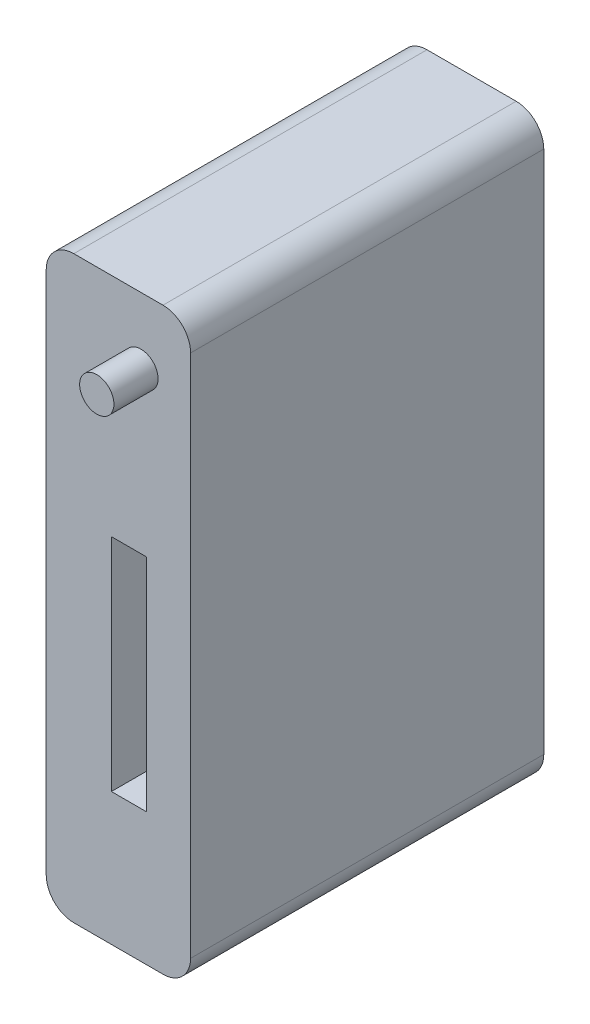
ISO-10303-21;
HEADER;
FILE_DESCRIPTION(('STEP AP214'),'2;1');
FILE_NAME('part.step','',(''),(''),'','','');
FILE_SCHEMA(('AUTOMOTIVE_DESIGN { 1 0 10303 214 1 1 1 1 }'));
ENDSEC;
DATA;
#1=APPLICATION_CONTEXT('core data for automotive mechanical design processes');
#2=APPLICATION_PROTOCOL_DEFINITION('international standard','automotive_design',2000,#1);
#3=PRODUCT_CONTEXT('',#1,'mechanical');
#4=PRODUCT('Part','Part','',(#3));
#5=PRODUCT_RELATED_PRODUCT_CATEGORY('part','',(#4));
#6=PRODUCT_DEFINITION_FORMATION('','',#4);
#7=PRODUCT_DEFINITION_CONTEXT('part definition',#1,'design');
#8=PRODUCT_DEFINITION('design','',#6,#7);
#9=PRODUCT_DEFINITION_SHAPE('','',#8);
#10=(LENGTH_UNIT() NAMED_UNIT(*) SI_UNIT(.MILLI.,.METRE.));
#11=(NAMED_UNIT(*) PLANE_ANGLE_UNIT() SI_UNIT($,.RADIAN.));
#12=(NAMED_UNIT(*) SI_UNIT($,.STERADIAN.) SOLID_ANGLE_UNIT());
#13=UNCERTAINTY_MEASURE_WITH_UNIT(LENGTH_MEASURE(1.E-05),#10,'distance_accuracy_value','');
#14=(GEOMETRIC_REPRESENTATION_CONTEXT(3) GLOBAL_UNCERTAINTY_ASSIGNED_CONTEXT((#13)) GLOBAL_UNIT_ASSIGNED_CONTEXT((#10,
#11,#12)) REPRESENTATION_CONTEXT('',''));
#15=CARTESIAN_POINT('',(0.,0.,0.));
#16=DIRECTION('',(0.,0.,1.));
#17=DIRECTION('',(1.,0.,0.));
#18=AXIS2_PLACEMENT_3D('',#15,#16,#17);
#19=CARTESIAN_POINT('',(-8.081,-47.5,32.));
#20=DIRECTION('',(0.,0.,-1.));
#21=DIRECTION('',(-1.,0.,0.));
#22=AXIS2_PLACEMENT_3D('',#19,#20,#21);
#23=CYLINDRICAL_SURFACE('',#22,5.);
#24=CARTESIAN_POINT('',(-8.081,-47.5,-32.));
#25=DIRECTION('',(0.,0.,1.));
#26=DIRECTION('',(-1.,0.,0.));
#27=AXIS2_PLACEMENT_3D('',#24,#25,#26);
#28=CIRCLE('',#27,5.);
#29=CARTESIAN_POINT('',(-13.081,-47.5,-32.));
#30=VERTEX_POINT('',#29);
#31=CARTESIAN_POINT('',(-8.081,-52.5,-32.));
#32=VERTEX_POINT('',#31);
#33=EDGE_CURVE('E141',#30,#32,#28,.T.);
#34=ORIENTED_EDGE('',*,*,#33,.T.);
#35=DIRECTION('',(0.,0.,-1.));
#36=VECTOR('',#35,1.);
#37=CARTESIAN_POINT('',(-8.081,-52.5,32.));
#38=LINE('',#37,#36);
#39=CARTESIAN_POINT('',(-8.081,-52.5,32.));
#40=VERTEX_POINT('',#39);
#41=EDGE_CURVE('E39',#40,#32,#38,.T.);
#42=ORIENTED_EDGE('',*,*,#41,.F.);
#43=CARTESIAN_POINT('',(-8.081,-47.5,32.));
#44=DIRECTION('',(0.,0.,1.));
#45=DIRECTION('',(-1.,0.,0.));
#46=AXIS2_PLACEMENT_3D('',#43,#44,#45);
#47=CIRCLE('',#46,5.);
#48=CARTESIAN_POINT('',(-13.081,-47.5,32.));
#49=VERTEX_POINT('',#48);
#50=EDGE_CURVE('E157',#49,#40,#47,.T.);
#51=ORIENTED_EDGE('',*,*,#50,.F.);
#52=DIRECTION('',(0.,0.,-1.));
#53=VECTOR('',#52,1.);
#54=CARTESIAN_POINT('',(-13.081,-47.5,32.));
#55=LINE('',#54,#53);
#56=EDGE_CURVE('E137',#49,#30,#55,.T.);
#57=ORIENTED_EDGE('',*,*,#56,.T.);
#58=EDGE_LOOP('',(#34,#42,#51,#57));
#59=FACE_BOUND('',#58,.T.);
#60=ADVANCED_FACE('F32',(#59),#23,.T.);
#61=CARTESIAN_POINT('',(-8.081,-52.5,32.));
#62=DIRECTION('',(0.,1.,0.));
#63=DIRECTION('',(0.,0.,1.));
#64=AXIS2_PLACEMENT_3D('',#61,#62,#63);
#65=PLANE('',#64);
#66=DIRECTION('',(1.,0.,0.));
#67=VECTOR('',#66,1.);
#68=CARTESIAN_POINT('',(-8.081,-52.5,-32.));
#69=LINE('',#68,#67);
#70=CARTESIAN_POINT('',(8.081,-52.5,-32.));
#71=VERTEX_POINT('',#70);
#72=EDGE_CURVE('E144',#32,#71,#69,.T.);
#73=ORIENTED_EDGE('',*,*,#72,.T.);
#74=DIRECTION('',(0.,0.,-1.));
#75=VECTOR('',#74,1.);
#76=CARTESIAN_POINT('',(8.081,-52.5,32.));
#77=LINE('',#76,#75);
#78=CARTESIAN_POINT('',(8.081,-52.5,32.));
#79=VERTEX_POINT('',#78);
#80=EDGE_CURVE('E167',#79,#71,#77,.T.);
#81=ORIENTED_EDGE('',*,*,#80,.F.);
#82=DIRECTION('',(1.,0.,0.));
#83=VECTOR('',#82,1.);
#84=CARTESIAN_POINT('',(-8.081,-52.5,32.));
#85=LINE('',#84,#83);
#86=EDGE_CURVE('E97',#40,#79,#85,.T.);
#87=ORIENTED_EDGE('',*,*,#86,.F.);
#88=ORIENTED_EDGE('',*,*,#41,.T.);
#89=EDGE_LOOP('',(#73,#81,#87,#88));
#90=FACE_BOUND('',#89,.T.);
#91=ADVANCED_FACE('F170',(#90),#65,.F.);
#92=CARTESIAN_POINT('',(8.081,-47.5,32.));
#93=DIRECTION('',(0.,0.,-1.));
#94=DIRECTION('',(-1.,0.,0.));
#95=AXIS2_PLACEMENT_3D('',#92,#93,#94);
#96=CYLINDRICAL_SURFACE('',#95,5.);
#97=CARTESIAN_POINT('',(8.081,-47.5,-32.));
#98=DIRECTION('',(0.,0.,1.));
#99=DIRECTION('',(1.,0.,0.));
#100=AXIS2_PLACEMENT_3D('',#97,#98,#99);
#101=CIRCLE('',#100,5.);
#102=CARTESIAN_POINT('',(13.081,-47.5,-32.));
#103=VERTEX_POINT('',#102);
#104=EDGE_CURVE('E147',#71,#103,#101,.T.);
#105=ORIENTED_EDGE('',*,*,#104,.T.);
#106=DIRECTION('',(0.,0.,-1.));
#107=VECTOR('',#106,1.);
#108=CARTESIAN_POINT('',(13.081,-47.5,32.));
#109=LINE('',#108,#107);
#110=CARTESIAN_POINT('',(13.081,-47.5,32.));
#111=VERTEX_POINT('',#110);
#112=EDGE_CURVE('E164',#111,#103,#109,.T.);
#113=ORIENTED_EDGE('',*,*,#112,.F.);
#114=CARTESIAN_POINT('',(8.081,-47.5,32.));
#115=DIRECTION('',(0.,0.,1.));
#116=DIRECTION('',(1.,0.,0.));
#117=AXIS2_PLACEMENT_3D('',#114,#115,#116);
#118=CIRCLE('',#117,5.);
#119=EDGE_CURVE('E188',#79,#111,#118,.T.);
#120=ORIENTED_EDGE('',*,*,#119,.F.);
#121=ORIENTED_EDGE('',*,*,#80,.T.);
#122=EDGE_LOOP('',(#105,#113,#120,#121));
#123=FACE_BOUND('',#122,.T.);
#124=ADVANCED_FACE('F181',(#123),#96,.T.);
#125=CARTESIAN_POINT('',(13.081,-47.5,32.));
#126=DIRECTION('',(-1.,0.,0.));
#127=DIRECTION('',(0.,0.,1.));
#128=AXIS2_PLACEMENT_3D('',#125,#126,#127);
#129=PLANE('',#128);
#130=DIRECTION('',(0.,1.,0.));
#131=VECTOR('',#130,1.);
#132=CARTESIAN_POINT('',(13.081,-47.5,-32.));
#133=LINE('',#132,#131);
#134=CARTESIAN_POINT('',(13.081,47.5,-32.));
#135=VERTEX_POINT('',#134);
#136=EDGE_CURVE('E149',#103,#135,#133,.T.);
#137=ORIENTED_EDGE('',*,*,#136,.T.);
#138=DIRECTION('',(0.,0.,-1.));
#139=VECTOR('',#138,1.);
#140=CARTESIAN_POINT('',(13.081,47.5,32.));
#141=LINE('',#140,#139);
#142=CARTESIAN_POINT('',(13.081,47.5,32.));
#143=VERTEX_POINT('',#142);
#144=EDGE_CURVE('E161',#143,#135,#141,.T.);
#145=ORIENTED_EDGE('',*,*,#144,.F.);
#146=DIRECTION('',(0.,1.,0.));
#147=VECTOR('',#146,1.);
#148=CARTESIAN_POINT('',(13.081,-47.5,32.));
#149=LINE('',#148,#147);
#150=EDGE_CURVE('E187',#111,#143,#149,.T.);
#151=ORIENTED_EDGE('',*,*,#150,.F.);
#152=ORIENTED_EDGE('',*,*,#112,.T.);
#153=EDGE_LOOP('',(#137,#145,#151,#152));
#154=FACE_BOUND('',#153,.T.);
#155=ADVANCED_FACE('F185',(#154),#129,.F.);
#156=CARTESIAN_POINT('',(8.081,47.5,32.));
#157=DIRECTION('',(0.,0.,-1.));
#158=DIRECTION('',(-1.,0.,0.));
#159=AXIS2_PLACEMENT_3D('',#156,#157,#158);
#160=CYLINDRICAL_SURFACE('',#159,5.);
#161=CARTESIAN_POINT('',(8.081,47.5,-32.));
#162=DIRECTION('',(0.,0.,1.));
#163=DIRECTION('',(-1.,0.,0.));
#164=AXIS2_PLACEMENT_3D('',#161,#162,#163);
#165=CIRCLE('',#164,5.);
#166=CARTESIAN_POINT('',(8.081,52.5,-32.));
#167=VERTEX_POINT('',#166);
#168=EDGE_CURVE('E151',#135,#167,#165,.T.);
#169=ORIENTED_EDGE('',*,*,#168,.T.);
#170=DIRECTION('',(0.,0.,-1.));
#171=VECTOR('',#170,1.);
#172=CARTESIAN_POINT('',(8.081,52.5,32.));
#173=LINE('',#172,#171);
#174=CARTESIAN_POINT('',(8.081,52.5,32.));
#175=VERTEX_POINT('',#174);
#176=EDGE_CURVE('E132',#175,#167,#173,.T.);
#177=ORIENTED_EDGE('',*,*,#176,.F.);
#178=CARTESIAN_POINT('',(8.081,47.5,32.));
#179=DIRECTION('',(0.,0.,1.));
#180=DIRECTION('',(-1.,0.,0.));
#181=AXIS2_PLACEMENT_3D('',#178,#179,#180);
#182=CIRCLE('',#181,5.);
#183=EDGE_CURVE('E120',#143,#175,#182,.T.);
#184=ORIENTED_EDGE('',*,*,#183,.F.);
#185=ORIENTED_EDGE('',*,*,#144,.T.);
#186=EDGE_LOOP('',(#169,#177,#184,#185));
#187=FACE_BOUND('',#186,.T.);
#188=ADVANCED_FACE('F288',(#187),#160,.T.);
#189=CARTESIAN_POINT('',(-8.081,52.5,32.));
#190=DIRECTION('',(0.,-1.,0.));
#191=DIRECTION('',(0.,0.,-1.));
#192=AXIS2_PLACEMENT_3D('',#189,#190,#191);
#193=PLANE('',#192);
#194=DIRECTION('',(-1.,0.,0.));
#195=VECTOR('',#194,1.);
#196=CARTESIAN_POINT('',(-8.081,52.5,-32.));
#197=LINE('',#196,#195);
#198=CARTESIAN_POINT('',(-8.081,52.5,-32.));
#199=VERTEX_POINT('',#198);
#200=EDGE_CURVE('E129',#167,#199,#197,.T.);
#201=ORIENTED_EDGE('',*,*,#200,.T.);
#202=DIRECTION('',(0.,0.,-1.));
#203=VECTOR('',#202,1.);
#204=CARTESIAN_POINT('',(-8.081,52.5,32.));
#205=LINE('',#204,#203);
#206=CARTESIAN_POINT('',(-8.081,52.5,32.));
#207=VERTEX_POINT('',#206);
#208=EDGE_CURVE('E126',#207,#199,#205,.T.);
#209=ORIENTED_EDGE('',*,*,#208,.F.);
#210=DIRECTION('',(-1.,0.,0.));
#211=VECTOR('',#210,1.);
#212=CARTESIAN_POINT('',(-8.081,52.5,32.));
#213=LINE('',#212,#211);
#214=EDGE_CURVE('E113',#175,#207,#213,.T.);
#215=ORIENTED_EDGE('',*,*,#214,.F.);
#216=ORIENTED_EDGE('',*,*,#176,.T.);
#217=EDGE_LOOP('',(#201,#209,#215,#216));
#218=FACE_BOUND('',#217,.T.);
#219=ADVANCED_FACE('F127',(#218),#193,.F.);
#220=CARTESIAN_POINT('',(-8.081,47.5,32.));
#221=DIRECTION('',(0.,0.,-1.));
#222=DIRECTION('',(-1.,0.,0.));
#223=AXIS2_PLACEMENT_3D('',#220,#221,#222);
#224=CYLINDRICAL_SURFACE('',#223,5.);
#225=CARTESIAN_POINT('',(-8.081,47.5,-32.));
#226=DIRECTION('',(0.,0.,1.));
#227=DIRECTION('',(-1.,0.,0.));
#228=AXIS2_PLACEMENT_3D('',#225,#226,#227);
#229=CIRCLE('',#228,5.);
#230=CARTESIAN_POINT('',(-13.081,47.5,-32.));
#231=VERTEX_POINT('',#230);
#232=EDGE_CURVE('E154',#199,#231,#229,.T.);
#233=ORIENTED_EDGE('',*,*,#232,.T.);
#234=DIRECTION('',(0.,0.,-1.));
#235=VECTOR('',#234,1.);
#236=CARTESIAN_POINT('',(-13.081,47.5,32.));
#237=LINE('',#236,#235);
#238=CARTESIAN_POINT('',(-13.081,47.5,32.));
#239=VERTEX_POINT('',#238);
#240=EDGE_CURVE('E133',#239,#231,#237,.T.);
#241=ORIENTED_EDGE('',*,*,#240,.F.);
#242=CARTESIAN_POINT('',(-8.081,47.5,32.));
#243=DIRECTION('',(0.,0.,1.));
#244=DIRECTION('',(-1.,0.,0.));
#245=AXIS2_PLACEMENT_3D('',#242,#243,#244);
#246=CIRCLE('',#245,5.);
#247=EDGE_CURVE('E117',#207,#239,#246,.T.);
#248=ORIENTED_EDGE('',*,*,#247,.F.);
#249=ORIENTED_EDGE('',*,*,#208,.T.);
#250=EDGE_LOOP('',(#233,#241,#248,#249));
#251=FACE_BOUND('',#250,.T.);
#252=ADVANCED_FACE('F135',(#251),#224,.T.);
#253=CARTESIAN_POINT('',(-13.081,-47.5,32.));
#254=DIRECTION('',(1.,0.,0.));
#255=DIRECTION('',(0.,0.,-1.));
#256=AXIS2_PLACEMENT_3D('',#253,#254,#255);
#257=PLANE('',#256);
#258=DIRECTION('',(0.,-1.,0.));
#259=VECTOR('',#258,1.);
#260=CARTESIAN_POINT('',(-13.081,-47.5,-32.));
#261=LINE('',#260,#259);
#262=EDGE_CURVE('E88',#231,#30,#261,.T.);
#263=ORIENTED_EDGE('',*,*,#262,.T.);
#264=ORIENTED_EDGE('',*,*,#56,.F.);
#265=DIRECTION('',(0.,-1.,0.));
#266=VECTOR('',#265,1.);
#267=CARTESIAN_POINT('',(-13.081,-47.5,32.));
#268=LINE('',#267,#266);
#269=EDGE_CURVE('E55',#239,#49,#268,.T.);
#270=ORIENTED_EDGE('',*,*,#269,.F.);
#271=ORIENTED_EDGE('',*,*,#240,.T.);
#272=EDGE_LOOP('',(#263,#264,#270,#271));
#273=FACE_BOUND('',#272,.T.);
#274=ADVANCED_FACE('F240',(#273),#257,.F.);
#275=CARTESIAN_POINT('',(-8.081,-47.5,32.));
#276=DIRECTION('',(0.,0.,-1.));
#277=DIRECTION('',(-1.,0.,0.));
#278=AXIS2_PLACEMENT_3D('',#275,#276,#277);
#279=PLANE('',#278);
#280=CARTESIAN_POINT('',(4.081,40.5,32.));
#281=DIRECTION('',(0.,0.,-1.));
#282=DIRECTION('',(-1.,0.,0.));
#283=AXIS2_PLACEMENT_3D('',#280,#281,#282);
#284=CIRCLE('',#283,3.105);
#285=CARTESIAN_POINT('',(0.975999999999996,40.5,32.));
#286=VERTEX_POINT('',#285);
#287=EDGE_CURVE('E11',#286,#286,#284,.F.);
#288=ORIENTED_EDGE('',*,*,#287,.F.);
#289=EDGE_LOOP('',(#288));
#290=FACE_BOUND('',#289,.T.);
#291=DIRECTION('',(1.,0.,0.));
#292=VECTOR('',#291,1.);
#293=CARTESIAN_POINT('',(-1.269,-28.5,32.));
#294=LINE('',#293,#292);
#295=CARTESIAN_POINT('',(-1.269,-28.5,32.));
#296=VERTEX_POINT('',#295);
#297=CARTESIAN_POINT('',(5.081,-28.5,32.));
#298=VERTEX_POINT('',#297);
#299=EDGE_CURVE('E211',#296,#298,#294,.T.);
#300=ORIENTED_EDGE('',*,*,#299,.F.);
#301=DIRECTION('',(0.,-1.,0.));
#302=VECTOR('',#301,1.);
#303=CARTESIAN_POINT('',(-1.269,-28.5,32.));
#304=LINE('',#303,#302);
#305=CARTESIAN_POINT('',(-1.269,11.5,32.));
#306=VERTEX_POINT('',#305);
#307=EDGE_CURVE('E46',#306,#296,#304,.T.);
#308=ORIENTED_EDGE('',*,*,#307,.F.);
#309=DIRECTION('',(-1.,0.,0.));
#310=VECTOR('',#309,1.);
#311=CARTESIAN_POINT('',(-1.269,11.5,32.));
#312=LINE('',#311,#310);
#313=CARTESIAN_POINT('',(5.081,11.5,32.));
#314=VERTEX_POINT('',#313);
#315=EDGE_CURVE('E204',#314,#306,#312,.T.);
#316=ORIENTED_EDGE('',*,*,#315,.F.);
#317=DIRECTION('',(0.,1.,0.));
#318=VECTOR('',#317,1.);
#319=CARTESIAN_POINT('',(5.081,-28.5,32.));
#320=LINE('',#319,#318);
#321=EDGE_CURVE('E208',#298,#314,#320,.T.);
#322=ORIENTED_EDGE('',*,*,#321,.F.);
#323=EDGE_LOOP('',(#300,#308,#316,#322));
#324=FACE_BOUND('',#323,.T.);
#325=ORIENTED_EDGE('',*,*,#50,.T.);
#326=ORIENTED_EDGE('',*,*,#86,.T.);
#327=ORIENTED_EDGE('',*,*,#119,.T.);
#328=ORIENTED_EDGE('',*,*,#150,.T.);
#329=ORIENTED_EDGE('',*,*,#183,.T.);
#330=ORIENTED_EDGE('',*,*,#214,.T.);
#331=ORIENTED_EDGE('',*,*,#247,.T.);
#332=ORIENTED_EDGE('',*,*,#269,.T.);
#333=EDGE_LOOP('',(#325,#326,#327,#328,#329,#330,#331,#332));
#334=FACE_BOUND('',#333,.T.);
#335=ADVANCED_FACE('F115',(#290,#324,#334),#279,.F.);
#336=CARTESIAN_POINT('',(-8.081,-47.5,-32.));
#337=DIRECTION('',(0.,0.,-1.));
#338=DIRECTION('',(-1.,0.,0.));
#339=AXIS2_PLACEMENT_3D('',#336,#337,#338);
#340=PLANE('',#339);
#341=ORIENTED_EDGE('',*,*,#33,.F.);
#342=ORIENTED_EDGE('',*,*,#262,.F.);
#343=ORIENTED_EDGE('',*,*,#232,.F.);
#344=ORIENTED_EDGE('',*,*,#200,.F.);
#345=ORIENTED_EDGE('',*,*,#168,.F.);
#346=ORIENTED_EDGE('',*,*,#136,.F.);
#347=ORIENTED_EDGE('',*,*,#104,.F.);
#348=ORIENTED_EDGE('',*,*,#72,.F.);
#349=EDGE_LOOP('',(#341,#342,#343,#344,#345,#346,#347,#348));
#350=FACE_BOUND('',#349,.T.);
#351=ADVANCED_FACE('F175',(#350),#340,.T.);
#352=CARTESIAN_POINT('',(-1.269,-28.5,24.38));
#353=DIRECTION('',(-1.,0.,0.));
#354=DIRECTION('',(0.,0.,1.));
#355=AXIS2_PLACEMENT_3D('',#352,#353,#354);
#356=PLANE('',#355);
#357=ORIENTED_EDGE('',*,*,#307,.T.);
#358=DIRECTION('',(0.,0.,1.));
#359=VECTOR('',#358,1.);
#360=CARTESIAN_POINT('',(-1.269,-28.5,24.38));
#361=LINE('',#360,#359);
#362=CARTESIAN_POINT('',(-1.269,-28.5,24.38));
#363=VERTEX_POINT('',#362);
#364=EDGE_CURVE('E194',#363,#296,#361,.T.);
#365=ORIENTED_EDGE('',*,*,#364,.F.);
#366=DIRECTION('',(0.,-1.,0.));
#367=VECTOR('',#366,1.);
#368=CARTESIAN_POINT('',(-1.269,-28.5,24.38));
#369=LINE('',#368,#367);
#370=CARTESIAN_POINT('',(-1.269,11.5,24.38));
#371=VERTEX_POINT('',#370);
#372=EDGE_CURVE('E207',#371,#363,#369,.T.);
#373=ORIENTED_EDGE('',*,*,#372,.F.);
#374=DIRECTION('',(0.,0.,1.));
#375=VECTOR('',#374,1.);
#376=CARTESIAN_POINT('',(-1.269,11.5,24.38));
#377=LINE('',#376,#375);
#378=EDGE_CURVE('E145',#371,#306,#377,.T.);
#379=ORIENTED_EDGE('',*,*,#378,.T.);
#380=EDGE_LOOP('',(#357,#365,#373,#379));
#381=FACE_BOUND('',#380,.T.);
#382=ADVANCED_FACE('F264',(#381),#356,.F.);
#383=CARTESIAN_POINT('',(-1.269,11.5,24.38));
#384=DIRECTION('',(0.,1.,0.));
#385=DIRECTION('',(0.,0.,1.));
#386=AXIS2_PLACEMENT_3D('',#383,#384,#385);
#387=PLANE('',#386);
#388=ORIENTED_EDGE('',*,*,#315,.T.);
#389=ORIENTED_EDGE('',*,*,#378,.F.);
#390=DIRECTION('',(-1.,0.,0.));
#391=VECTOR('',#390,1.);
#392=CARTESIAN_POINT('',(-1.269,11.5,24.38));
#393=LINE('',#392,#391);
#394=CARTESIAN_POINT('',(5.081,11.5,24.38));
#395=VERTEX_POINT('',#394);
#396=EDGE_CURVE('E197',#395,#371,#393,.T.);
#397=ORIENTED_EDGE('',*,*,#396,.F.);
#398=DIRECTION('',(0.,0.,1.));
#399=VECTOR('',#398,1.);
#400=CARTESIAN_POINT('',(5.081,11.5,24.38));
#401=LINE('',#400,#399);
#402=EDGE_CURVE('E200',#395,#314,#401,.T.);
#403=ORIENTED_EDGE('',*,*,#402,.T.);
#404=EDGE_LOOP('',(#388,#389,#397,#403));
#405=FACE_BOUND('',#404,.T.);
#406=ADVANCED_FACE('F267',(#405),#387,.F.);
#407=CARTESIAN_POINT('',(5.081,-28.5,24.38));
#408=DIRECTION('',(1.,0.,0.));
#409=DIRECTION('',(0.,0.,-1.));
#410=AXIS2_PLACEMENT_3D('',#407,#408,#409);
#411=PLANE('',#410);
#412=ORIENTED_EDGE('',*,*,#321,.T.);
#413=ORIENTED_EDGE('',*,*,#402,.F.);
#414=DIRECTION('',(0.,1.,0.));
#415=VECTOR('',#414,1.);
#416=CARTESIAN_POINT('',(5.081,-28.5,24.38));
#417=LINE('',#416,#415);
#418=CARTESIAN_POINT('',(5.081,-28.5,24.38));
#419=VERTEX_POINT('',#418);
#420=EDGE_CURVE('E218',#419,#395,#417,.T.);
#421=ORIENTED_EDGE('',*,*,#420,.F.);
#422=DIRECTION('',(0.,0.,1.));
#423=VECTOR('',#422,1.);
#424=CARTESIAN_POINT('',(5.081,-28.5,24.38));
#425=LINE('',#424,#423);
#426=EDGE_CURVE('E196',#419,#298,#425,.T.);
#427=ORIENTED_EDGE('',*,*,#426,.T.);
#428=EDGE_LOOP('',(#412,#413,#421,#427));
#429=FACE_BOUND('',#428,.T.);
#430=ADVANCED_FACE('F268',(#429),#411,.F.);
#431=CARTESIAN_POINT('',(-1.269,-28.5,24.38));
#432=DIRECTION('',(0.,-1.,0.));
#433=DIRECTION('',(0.,0.,-1.));
#434=AXIS2_PLACEMENT_3D('',#431,#432,#433);
#435=PLANE('',#434);
#436=ORIENTED_EDGE('',*,*,#299,.T.);
#437=ORIENTED_EDGE('',*,*,#426,.F.);
#438=DIRECTION('',(1.,0.,0.));
#439=VECTOR('',#438,1.);
#440=CARTESIAN_POINT('',(-1.269,-28.5,24.38));
#441=LINE('',#440,#439);
#442=EDGE_CURVE('E221',#363,#419,#441,.T.);
#443=ORIENTED_EDGE('',*,*,#442,.F.);
#444=ORIENTED_EDGE('',*,*,#364,.T.);
#445=EDGE_LOOP('',(#436,#437,#443,#444));
#446=FACE_BOUND('',#445,.T.);
#447=ADVANCED_FACE('F248',(#446),#435,.F.);
#448=CARTESIAN_POINT('',(0.,0.,24.38));
#449=DIRECTION('',(0.,0.,-1.));
#450=DIRECTION('',(-1.,0.,0.));
#451=AXIS2_PLACEMENT_3D('',#448,#449,#450);
#452=PLANE('',#451);
#453=ORIENTED_EDGE('',*,*,#372,.T.);
#454=ORIENTED_EDGE('',*,*,#442,.T.);
#455=ORIENTED_EDGE('',*,*,#420,.T.);
#456=ORIENTED_EDGE('',*,*,#396,.T.);
#457=EDGE_LOOP('',(#453,#454,#455,#456));
#458=FACE_BOUND('',#457,.T.);
#459=ADVANCED_FACE('F234',(#458),#452,.F.);
#460=CARTESIAN_POINT('',(4.081,40.5,40.));
#461=DIRECTION('',(0.,0.,-1.));
#462=DIRECTION('',(-1.,0.,0.));
#463=AXIS2_PLACEMENT_3D('',#460,#461,#462);
#464=CYLINDRICAL_SURFACE('',#463,3.105);
#465=CARTESIAN_POINT('',(4.081,40.5,40.));
#466=DIRECTION('',(0.,0.,1.));
#467=DIRECTION('',(1.,0.,0.));
#468=AXIS2_PLACEMENT_3D('',#465,#466,#467);
#469=CIRCLE('',#468,3.105);
#470=CARTESIAN_POINT('',(7.186,40.5,40.));
#471=VERTEX_POINT('',#470);
#472=EDGE_CURVE('E215',#471,#471,#469,.T.);
#473=ORIENTED_EDGE('',*,*,#472,.F.);
#474=EDGE_LOOP('',(#473));
#475=FACE_BOUND('',#474,.T.);
#476=ORIENTED_EDGE('',*,*,#287,.T.);
#477=EDGE_LOOP('',(#476));
#478=FACE_BOUND('',#477,.T.);
#479=ADVANCED_FACE('F231',(#475,#478),#464,.T.);
#480=CARTESIAN_POINT('',(4.081,40.5,40.));
#481=DIRECTION('',(0.,0.,1.));
#482=DIRECTION('',(1.,0.,0.));
#483=AXIS2_PLACEMENT_3D('',#480,#481,#482);
#484=PLANE('',#483);
#485=ORIENTED_EDGE('',*,*,#472,.T.);
#486=EDGE_LOOP('',(#485));
#487=FACE_BOUND('',#486,.T.);
#488=ADVANCED_FACE('F229',(#487),#484,.T.);
#489=CLOSED_SHELL('',(#60,#91,#124,#155,#188,#219,#252,#274,#335,#351,#382,#406,#430,#447,#459,
#479,#488));
#490=MANIFOLD_SOLID_BREP('B2',#489);
#491=ADVANCED_BREP_SHAPE_REPRESENTATION('',(#18,#490),#14);
#492=SHAPE_DEFINITION_REPRESENTATION(#9,#491);
ENDSEC;
END-ISO-10303-21;
